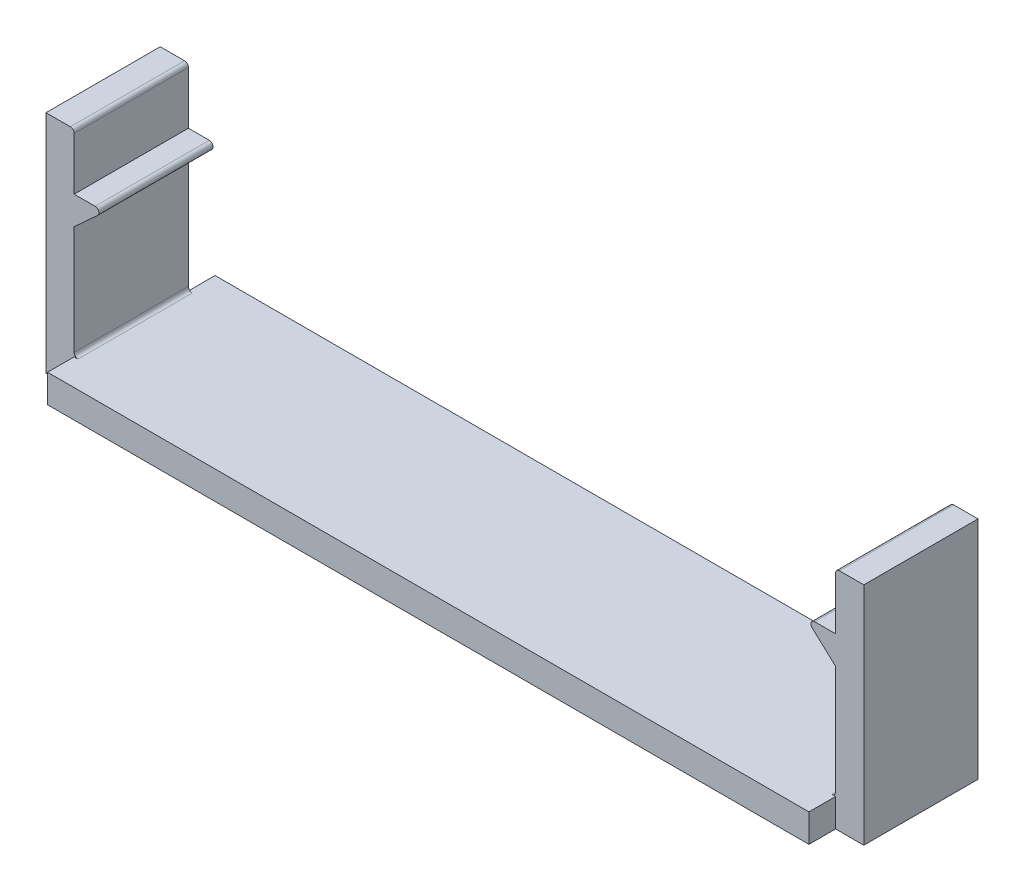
from build123d import *

# Parameters (mm, degrees)
CLIPS_DEPTH             = 1.905
CLIPS_2_DEPTH           = 1.905
BASE_OUTLINE_ADHESIVE_W = 25.4
BASE_OUTLINE_ADHESIVE_H = 0.9398
ADHESIVE_BASE_DEPTH     = 2.794
FILLET2_R               = 0.127


with BuildPart() as part:
    # Clips Outline → Clips (new, symmetric)
    with BuildSketch(Plane.XY):
        Polygon((12.7, 3.7592), (11.676950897, 4.699), (12.7, 4.699), (12.7, 6.58368), (13.6398, 6.58368), (13.6398, -0.9398), (12.7, -0.9398), (12.7, 0), align=None)
    extrude(amount=CLIPS_DEPTH, both=True)



with BuildPart() as body_2:
    # Clips Outline → Clips 2 (new, symmetric)
    with BuildSketch(Plane.XY):
        Polygon((-12.7, 0), (-12.7, 3.7592), (-11.676950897, 4.699), (-12.7, 4.699), (-12.7, 6.58368), (-13.6398, 6.58368), (-13.6398, -0.9398), (-12.7, -0.9398), align=None)
    extrude(amount=CLIPS_2_DEPTH, both=True)


with BuildPart() as part_1:
    add(part.part)

    add(body_2.part)  # Adhesive Base merges body 2
    # Base Outline Adhesive → Adhesive Base (add, symmetric)
    with BuildSketch(Plane.XY):
        with Locations((0, -0.4699)):
            Rectangle(BASE_OUTLINE_ADHESIVE_W, BASE_OUTLINE_ADHESIVE_H)
    extrude(amount=ADHESIVE_BASE_DEPTH, both=True)

    # Fillet2
    fillet2_edges = [part_1.edges().sort_by_distance(p)[0] for p in [
        (-12.7, 6.58368, 0),
        (-11.676950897, 4.699, 0),
        (-12.7, 0, 0),
        (12.7, 0, 0),
        (12.7, 6.58368, 0),
        (11.676950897, 4.699, 0),
    ]]
    fillet(fillet2_edges, radius=FILLET2_R)


solid = part_1.part
